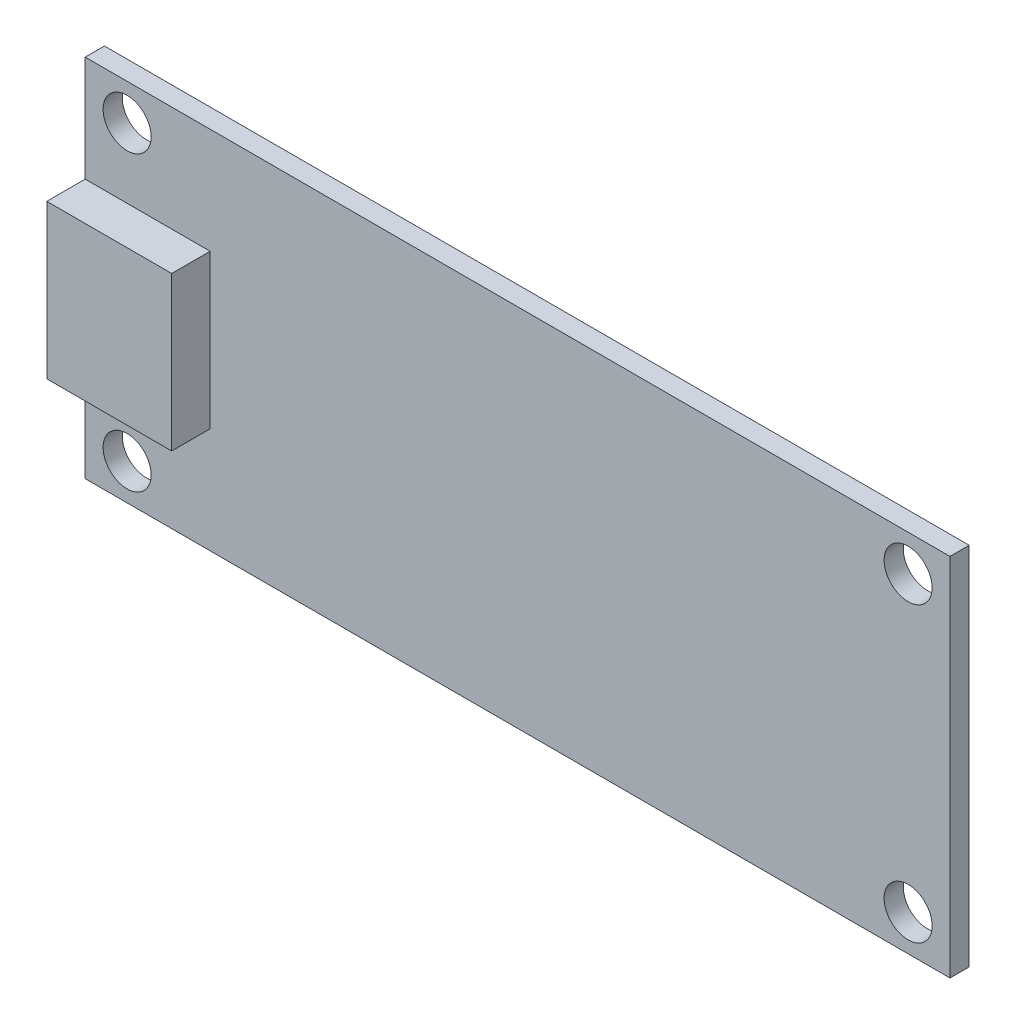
ISO-10303-21;
HEADER;
FILE_DESCRIPTION(('STEP AP214'),'2;1');
FILE_NAME('part.step','',(''),(''),'','','');
FILE_SCHEMA(('AUTOMOTIVE_DESIGN { 1 0 10303 214 1 1 1 1 }'));
ENDSEC;
DATA;
#1=APPLICATION_CONTEXT('core data for automotive mechanical design processes');
#2=APPLICATION_PROTOCOL_DEFINITION('international standard','automotive_design',2000,#1);
#3=PRODUCT_CONTEXT('',#1,'mechanical');
#4=PRODUCT('Part','Part','',(#3));
#5=PRODUCT_RELATED_PRODUCT_CATEGORY('part','',(#4));
#6=PRODUCT_DEFINITION_FORMATION('','',#4);
#7=PRODUCT_DEFINITION_CONTEXT('part definition',#1,'design');
#8=PRODUCT_DEFINITION('design','',#6,#7);
#9=PRODUCT_DEFINITION_SHAPE('','',#8);
#10=(LENGTH_UNIT() NAMED_UNIT(*) SI_UNIT(.MILLI.,.METRE.));
#11=(NAMED_UNIT(*) PLANE_ANGLE_UNIT() SI_UNIT($,.RADIAN.));
#12=(NAMED_UNIT(*) SI_UNIT($,.STERADIAN.) SOLID_ANGLE_UNIT());
#13=UNCERTAINTY_MEASURE_WITH_UNIT(LENGTH_MEASURE(1.E-05),#10,'distance_accuracy_value','');
#14=(GEOMETRIC_REPRESENTATION_CONTEXT(3) GLOBAL_UNCERTAINTY_ASSIGNED_CONTEXT((#13)) GLOBAL_UNIT_ASSIGNED_CONTEXT((#10,
#11,#12)) REPRESENTATION_CONTEXT('',''));
#15=CARTESIAN_POINT('',(0.,0.,0.));
#16=DIRECTION('',(0.,0.,1.));
#17=DIRECTION('',(1.,0.,0.));
#18=AXIS2_PLACEMENT_3D('',#15,#16,#17);
#19=CARTESIAN_POINT('',(0.,9.5,1.));
#20=DIRECTION('',(0.,1.,0.));
#21=DIRECTION('',(0.,0.,1.));
#22=AXIS2_PLACEMENT_3D('',#19,#20,#21);
#23=PLANE('',#22);
#24=DIRECTION('',(1.,0.,0.));
#25=VECTOR('',#24,1.);
#26=CARTESIAN_POINT('',(0.,9.5,0.));
#27=LINE('',#26,#25);
#28=CARTESIAN_POINT('',(-22.5,9.5,0.));
#29=VERTEX_POINT('',#28);
#30=CARTESIAN_POINT('',(22.5,9.5,0.));
#31=VERTEX_POINT('',#30);
#32=EDGE_CURVE('E162',#29,#31,#27,.T.);
#33=ORIENTED_EDGE('',*,*,#32,.F.);
#34=DIRECTION('',(0.,0.,-1.));
#35=VECTOR('',#34,1.);
#36=CARTESIAN_POINT('',(-22.5,9.5,1.));
#37=LINE('',#36,#35);
#38=CARTESIAN_POINT('',(-22.5,9.5,1.));
#39=VERTEX_POINT('',#38);
#40=EDGE_CURVE('E11',#39,#29,#37,.T.);
#41=ORIENTED_EDGE('',*,*,#40,.F.);
#42=DIRECTION('',(1.,0.,0.));
#43=VECTOR('',#42,1.);
#44=CARTESIAN_POINT('',(0.,9.5,1.));
#45=LINE('',#44,#43);
#46=CARTESIAN_POINT('',(22.5,9.5,1.));
#47=VERTEX_POINT('',#46);
#48=EDGE_CURVE('E142',#39,#47,#45,.T.);
#49=ORIENTED_EDGE('',*,*,#48,.T.);
#50=DIRECTION('',(0.,0.,-1.));
#51=VECTOR('',#50,1.);
#52=CARTESIAN_POINT('',(22.5,9.5,1.));
#53=LINE('',#52,#51);
#54=EDGE_CURVE('E155',#47,#31,#53,.T.);
#55=ORIENTED_EDGE('',*,*,#54,.T.);
#56=EDGE_LOOP('',(#33,#41,#49,#55));
#57=FACE_BOUND('',#56,.T.);
#58=ADVANCED_FACE('F36',(#57),#23,.T.);
#59=CARTESIAN_POINT('',(-22.5,0.,1.));
#60=DIRECTION('',(-1.,0.,0.));
#61=DIRECTION('',(0.,0.,1.));
#62=AXIS2_PLACEMENT_3D('',#59,#60,#61);
#63=PLANE('',#62);
#64=DIRECTION('',(0.,1.,0.));
#65=VECTOR('',#64,1.);
#66=CARTESIAN_POINT('',(-22.5,0.,0.));
#67=LINE('',#66,#65);
#68=CARTESIAN_POINT('',(-22.5,-9.5,0.));
#69=VERTEX_POINT('',#68);
#70=EDGE_CURVE('E165',#69,#29,#67,.T.);
#71=ORIENTED_EDGE('',*,*,#70,.F.);
#72=DIRECTION('',(0.,0.,-1.));
#73=VECTOR('',#72,1.);
#74=CARTESIAN_POINT('',(-22.5,-9.5,1.));
#75=LINE('',#74,#73);
#76=CARTESIAN_POINT('',(-22.5,-9.5,1.));
#77=VERTEX_POINT('',#76);
#78=EDGE_CURVE('E44',#77,#69,#75,.T.);
#79=ORIENTED_EDGE('',*,*,#78,.F.);
#80=DIRECTION('',(0.,1.,0.));
#81=VECTOR('',#80,1.);
#82=CARTESIAN_POINT('',(-22.5,0.,1.));
#83=LINE('',#82,#81);
#84=CARTESIAN_POINT('',(-22.5,-4.,1.));
#85=VERTEX_POINT('',#84);
#86=EDGE_CURVE('E145',#77,#85,#83,.T.);
#87=ORIENTED_EDGE('',*,*,#86,.T.);
#88=DIRECTION('',(0.,0.,-1.));
#89=VECTOR('',#88,1.);
#90=CARTESIAN_POINT('',(-22.5,-4.,3.));
#91=LINE('',#90,#89);
#92=CARTESIAN_POINT('',(-22.5,-4.,3.));
#93=VERTEX_POINT('',#92);
#94=EDGE_CURVE('E199',#93,#85,#91,.T.);
#95=ORIENTED_EDGE('',*,*,#94,.F.);
#96=DIRECTION('',(0.,1.,0.));
#97=VECTOR('',#96,1.);
#98=CARTESIAN_POINT('',(-22.5,0.,3.));
#99=LINE('',#98,#97);
#100=CARTESIAN_POINT('',(-22.5,4.,3.));
#101=VERTEX_POINT('',#100);
#102=EDGE_CURVE('E116',#93,#101,#99,.T.);
#103=ORIENTED_EDGE('',*,*,#102,.T.);
#104=DIRECTION('',(0.,0.,-1.));
#105=VECTOR('',#104,1.);
#106=CARTESIAN_POINT('',(-22.5,4.,3.));
#107=LINE('',#106,#105);
#108=CARTESIAN_POINT('',(-22.5,4.,1.));
#109=VERTEX_POINT('',#108);
#110=EDGE_CURVE('E128',#101,#109,#107,.T.);
#111=ORIENTED_EDGE('',*,*,#110,.T.);
#112=EDGE_CURVE('E57',#109,#39,#83,.T.);
#113=ORIENTED_EDGE('',*,*,#112,.T.);
#114=ORIENTED_EDGE('',*,*,#40,.T.);
#115=EDGE_LOOP('',(#71,#79,#87,#95,#103,#111,#113,#114));
#116=FACE_BOUND('',#115,.T.);
#117=ADVANCED_FACE('F190',(#116),#63,.T.);
#118=CARTESIAN_POINT('',(0.,-9.5,1.));
#119=DIRECTION('',(0.,1.,0.));
#120=DIRECTION('',(0.,0.,1.));
#121=AXIS2_PLACEMENT_3D('',#118,#119,#120);
#122=PLANE('',#121);
#123=DIRECTION('',(1.,0.,0.));
#124=VECTOR('',#123,1.);
#125=CARTESIAN_POINT('',(0.,-9.5,0.));
#126=LINE('',#125,#124);
#127=CARTESIAN_POINT('',(22.5,-9.5,0.));
#128=VERTEX_POINT('',#127);
#129=EDGE_CURVE('E168',#69,#128,#126,.T.);
#130=ORIENTED_EDGE('',*,*,#129,.T.);
#131=DIRECTION('',(0.,0.,-1.));
#132=VECTOR('',#131,1.);
#133=CARTESIAN_POINT('',(22.5,-9.5,1.));
#134=LINE('',#133,#132);
#135=CARTESIAN_POINT('',(22.5,-9.5,1.));
#136=VERTEX_POINT('',#135);
#137=EDGE_CURVE('E177',#136,#128,#134,.T.);
#138=ORIENTED_EDGE('',*,*,#137,.F.);
#139=DIRECTION('',(1.,0.,0.));
#140=VECTOR('',#139,1.);
#141=CARTESIAN_POINT('',(0.,-9.5,1.));
#142=LINE('',#141,#140);
#143=EDGE_CURVE('E148',#77,#136,#142,.T.);
#144=ORIENTED_EDGE('',*,*,#143,.F.);
#145=ORIENTED_EDGE('',*,*,#78,.T.);
#146=EDGE_LOOP('',(#130,#138,#144,#145));
#147=FACE_BOUND('',#146,.T.);
#148=ADVANCED_FACE('F182',(#147),#122,.F.);
#149=CARTESIAN_POINT('',(22.5,0.,1.));
#150=DIRECTION('',(-1.,0.,0.));
#151=DIRECTION('',(0.,0.,1.));
#152=AXIS2_PLACEMENT_3D('',#149,#150,#151);
#153=PLANE('',#152);
#154=DIRECTION('',(0.,1.,0.));
#155=VECTOR('',#154,1.);
#156=CARTESIAN_POINT('',(22.5,0.,0.));
#157=LINE('',#156,#155);
#158=EDGE_CURVE('E171',#128,#31,#157,.T.);
#159=ORIENTED_EDGE('',*,*,#158,.T.);
#160=ORIENTED_EDGE('',*,*,#54,.F.);
#161=DIRECTION('',(0.,1.,0.));
#162=VECTOR('',#161,1.);
#163=CARTESIAN_POINT('',(22.5,0.,1.));
#164=LINE('',#163,#162);
#165=EDGE_CURVE('E151',#136,#47,#164,.T.);
#166=ORIENTED_EDGE('',*,*,#165,.F.);
#167=ORIENTED_EDGE('',*,*,#137,.T.);
#168=EDGE_LOOP('',(#159,#160,#166,#167));
#169=FACE_BOUND('',#168,.T.);
#170=ADVANCED_FACE('F196',(#169),#153,.F.);
#171=CARTESIAN_POINT('',(-20.32,-7.62,1.));
#172=DIRECTION('',(0.,0.,-1.));
#173=DIRECTION('',(-1.,0.,0.));
#174=AXIS2_PLACEMENT_3D('',#171,#172,#173);
#175=CYLINDRICAL_SURFACE('',#174,1.25);
#176=CARTESIAN_POINT('',(-20.32,-7.62,1.));
#177=DIRECTION('',(0.,0.,1.));
#178=DIRECTION('',(1.,0.,0.));
#179=AXIS2_PLACEMENT_3D('',#176,#177,#178);
#180=CIRCLE('',#179,1.25);
#181=CARTESIAN_POINT('',(-19.07,-7.62,1.));
#182=VERTEX_POINT('',#181);
#183=EDGE_CURVE('E139',#182,#182,#180,.T.);
#184=ORIENTED_EDGE('',*,*,#183,.T.);
#185=EDGE_LOOP('',(#184));
#186=FACE_BOUND('',#185,.T.);
#187=CARTESIAN_POINT('',(-20.32,-7.62,0.));
#188=DIRECTION('',(0.,0.,1.));
#189=DIRECTION('',(1.,0.,0.));
#190=AXIS2_PLACEMENT_3D('',#187,#188,#189);
#191=CIRCLE('',#190,1.25);
#192=CARTESIAN_POINT('',(-19.07,-7.62,0.));
#193=VERTEX_POINT('',#192);
#194=EDGE_CURVE('E159',#193,#193,#191,.T.);
#195=ORIENTED_EDGE('',*,*,#194,.F.);
#196=EDGE_LOOP('',(#195));
#197=FACE_BOUND('',#196,.T.);
#198=ADVANCED_FACE('F225',(#186,#197),#175,.F.);
#199=CARTESIAN_POINT('',(-20.32,7.62,1.));
#200=DIRECTION('',(0.,0.,-1.));
#201=DIRECTION('',(-1.,0.,0.));
#202=AXIS2_PLACEMENT_3D('',#199,#200,#201);
#203=CYLINDRICAL_SURFACE('',#202,1.25);
#204=CARTESIAN_POINT('',(-20.32,7.62,1.));
#205=DIRECTION('',(0.,0.,1.));
#206=DIRECTION('',(1.,0.,0.));
#207=AXIS2_PLACEMENT_3D('',#204,#205,#206);
#208=CIRCLE('',#207,1.25);
#209=CARTESIAN_POINT('',(-19.07,7.62,1.));
#210=VERTEX_POINT('',#209);
#211=EDGE_CURVE('E135',#210,#210,#208,.F.);
#212=ORIENTED_EDGE('',*,*,#211,.F.);
#213=EDGE_LOOP('',(#212));
#214=FACE_BOUND('',#213,.T.);
#215=CARTESIAN_POINT('',(-20.32,7.62,0.));
#216=DIRECTION('',(0.,0.,1.));
#217=DIRECTION('',(1.,0.,0.));
#218=AXIS2_PLACEMENT_3D('',#215,#216,#217);
#219=CIRCLE('',#218,1.25);
#220=CARTESIAN_POINT('',(-19.07,7.62,0.));
#221=VERTEX_POINT('',#220);
#222=EDGE_CURVE('E126',#221,#221,#219,.F.);
#223=ORIENTED_EDGE('',*,*,#222,.T.);
#224=EDGE_LOOP('',(#223));
#225=FACE_BOUND('',#224,.T.);
#226=ADVANCED_FACE('F227',(#214,#225),#203,.F.);
#227=CARTESIAN_POINT('',(20.32,7.62,1.));
#228=DIRECTION('',(0.,0.,-1.));
#229=DIRECTION('',(-1.,0.,0.));
#230=AXIS2_PLACEMENT_3D('',#227,#228,#229);
#231=CYLINDRICAL_SURFACE('',#230,1.25);
#232=CARTESIAN_POINT('',(20.32,7.62,1.));
#233=DIRECTION('',(0.,0.,1.));
#234=DIRECTION('',(1.,0.,0.));
#235=AXIS2_PLACEMENT_3D('',#232,#233,#234);
#236=CIRCLE('',#235,1.25);
#237=CARTESIAN_POINT('',(21.57,7.62,1.));
#238=VERTEX_POINT('',#237);
#239=EDGE_CURVE('E132',#238,#238,#236,.T.);
#240=ORIENTED_EDGE('',*,*,#239,.T.);
#241=EDGE_LOOP('',(#240));
#242=FACE_BOUND('',#241,.T.);
#243=CARTESIAN_POINT('',(20.32,7.62,0.));
#244=DIRECTION('',(0.,0.,1.));
#245=DIRECTION('',(1.,0.,0.));
#246=AXIS2_PLACEMENT_3D('',#243,#244,#245);
#247=CIRCLE('',#246,1.25);
#248=CARTESIAN_POINT('',(21.57,7.62,0.));
#249=VERTEX_POINT('',#248);
#250=EDGE_CURVE('E123',#249,#249,#247,.T.);
#251=ORIENTED_EDGE('',*,*,#250,.F.);
#252=EDGE_LOOP('',(#251));
#253=FACE_BOUND('',#252,.T.);
#254=ADVANCED_FACE('F38',(#242,#253),#231,.F.);
#255=CARTESIAN_POINT('',(20.32,-7.61999999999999,1.));
#256=DIRECTION('',(0.,0.,-1.));
#257=DIRECTION('',(-1.,0.,0.));
#258=AXIS2_PLACEMENT_3D('',#255,#256,#257);
#259=CYLINDRICAL_SURFACE('',#258,1.25);
#260=CARTESIAN_POINT('',(20.32,-7.61999999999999,1.));
#261=DIRECTION('',(0.,0.,1.));
#262=DIRECTION('',(1.,0.,0.));
#263=AXIS2_PLACEMENT_3D('',#260,#261,#262);
#264=CIRCLE('',#263,1.25);
#265=CARTESIAN_POINT('',(21.57,-7.61999999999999,1.));
#266=VERTEX_POINT('',#265);
#267=EDGE_CURVE('E153',#266,#266,#264,.F.);
#268=ORIENTED_EDGE('',*,*,#267,.F.);
#269=EDGE_LOOP('',(#268));
#270=FACE_BOUND('',#269,.T.);
#271=CARTESIAN_POINT('',(20.32,-7.61999999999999,0.));
#272=DIRECTION('',(0.,0.,1.));
#273=DIRECTION('',(1.,0.,0.));
#274=AXIS2_PLACEMENT_3D('',#271,#272,#273);
#275=CIRCLE('',#274,1.25);
#276=CARTESIAN_POINT('',(21.57,-7.61999999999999,0.));
#277=VERTEX_POINT('',#276);
#278=EDGE_CURVE('E136',#277,#277,#275,.F.);
#279=ORIENTED_EDGE('',*,*,#278,.T.);
#280=EDGE_LOOP('',(#279));
#281=FACE_BOUND('',#280,.T.);
#282=ADVANCED_FACE('F234',(#270,#281),#259,.F.);
#283=CARTESIAN_POINT('',(0.,0.,1.));
#284=DIRECTION('',(0.,0.,1.));
#285=DIRECTION('',(1.,0.,0.));
#286=AXIS2_PLACEMENT_3D('',#283,#284,#285);
#287=PLANE('',#286);
#288=DIRECTION('',(1.,0.,0.));
#289=VECTOR('',#288,1.);
#290=CARTESIAN_POINT('',(0.,-4.,1.));
#291=LINE('',#290,#289);
#292=CARTESIAN_POINT('',(-16.,-4.,1.));
#293=VERTEX_POINT('',#292);
#294=EDGE_CURVE('E122',#85,#293,#291,.T.);
#295=ORIENTED_EDGE('',*,*,#294,.F.);
#296=ORIENTED_EDGE('',*,*,#86,.F.);
#297=ORIENTED_EDGE('',*,*,#143,.T.);
#298=ORIENTED_EDGE('',*,*,#165,.T.);
#299=ORIENTED_EDGE('',*,*,#48,.F.);
#300=ORIENTED_EDGE('',*,*,#112,.F.);
#301=DIRECTION('',(1.,0.,0.));
#302=VECTOR('',#301,1.);
#303=CARTESIAN_POINT('',(0.,4.,1.));
#304=LINE('',#303,#302);
#305=CARTESIAN_POINT('',(-16.,4.,1.));
#306=VERTEX_POINT('',#305);
#307=EDGE_CURVE('E119',#109,#306,#304,.T.);
#308=ORIENTED_EDGE('',*,*,#307,.T.);
#309=DIRECTION('',(0.,1.,0.));
#310=VECTOR('',#309,1.);
#311=CARTESIAN_POINT('',(-16.,0.,1.));
#312=LINE('',#311,#310);
#313=EDGE_CURVE('E51',#293,#306,#312,.T.);
#314=ORIENTED_EDGE('',*,*,#313,.F.);
#315=EDGE_LOOP('',(#295,#296,#297,#298,#299,#300,#308,#314));
#316=FACE_BOUND('',#315,.T.);
#317=ORIENTED_EDGE('',*,*,#239,.F.);
#318=EDGE_LOOP('',(#317));
#319=FACE_BOUND('',#318,.T.);
#320=ORIENTED_EDGE('',*,*,#211,.T.);
#321=EDGE_LOOP('',(#320));
#322=FACE_BOUND('',#321,.T.);
#323=ORIENTED_EDGE('',*,*,#183,.F.);
#324=EDGE_LOOP('',(#323));
#325=FACE_BOUND('',#324,.T.);
#326=ORIENTED_EDGE('',*,*,#267,.T.);
#327=EDGE_LOOP('',(#326));
#328=FACE_BOUND('',#327,.T.);
#329=ADVANCED_FACE('F197',(#316,#319,#322,#325,#328),#287,.T.);
#330=CARTESIAN_POINT('',(0.,0.,0.));
#331=DIRECTION('',(0.,0.,1.));
#332=DIRECTION('',(1.,0.,0.));
#333=AXIS2_PLACEMENT_3D('',#330,#331,#332);
#334=PLANE('',#333);
#335=ORIENTED_EDGE('',*,*,#250,.T.);
#336=EDGE_LOOP('',(#335));
#337=FACE_BOUND('',#336,.T.);
#338=ORIENTED_EDGE('',*,*,#222,.F.);
#339=EDGE_LOOP('',(#338));
#340=FACE_BOUND('',#339,.T.);
#341=ORIENTED_EDGE('',*,*,#194,.T.);
#342=EDGE_LOOP('',(#341));
#343=FACE_BOUND('',#342,.T.);
#344=ORIENTED_EDGE('',*,*,#32,.T.);
#345=ORIENTED_EDGE('',*,*,#158,.F.);
#346=ORIENTED_EDGE('',*,*,#129,.F.);
#347=ORIENTED_EDGE('',*,*,#70,.T.);
#348=EDGE_LOOP('',(#344,#345,#346,#347));
#349=FACE_BOUND('',#348,.T.);
#350=ORIENTED_EDGE('',*,*,#278,.F.);
#351=EDGE_LOOP('',(#350));
#352=FACE_BOUND('',#351,.T.);
#353=ADVANCED_FACE('F188',(#337,#340,#343,#349,#352),#334,.F.);
#354=CARTESIAN_POINT('',(0.,-4.,3.));
#355=DIRECTION('',(0.,1.,0.));
#356=DIRECTION('',(0.,0.,1.));
#357=AXIS2_PLACEMENT_3D('',#354,#355,#356);
#358=PLANE('',#357);
#359=ORIENTED_EDGE('',*,*,#294,.T.);
#360=DIRECTION('',(0.,0.,-1.));
#361=VECTOR('',#360,1.);
#362=CARTESIAN_POINT('',(-16.,-4.,3.));
#363=LINE('',#362,#361);
#364=CARTESIAN_POINT('',(-16.,-4.,3.));
#365=VERTEX_POINT('',#364);
#366=EDGE_CURVE('E102',#365,#293,#363,.T.);
#367=ORIENTED_EDGE('',*,*,#366,.F.);
#368=DIRECTION('',(1.,0.,0.));
#369=VECTOR('',#368,1.);
#370=CARTESIAN_POINT('',(0.,-4.,3.));
#371=LINE('',#370,#369);
#372=EDGE_CURVE('E110',#93,#365,#371,.T.);
#373=ORIENTED_EDGE('',*,*,#372,.F.);
#374=ORIENTED_EDGE('',*,*,#94,.T.);
#375=EDGE_LOOP('',(#359,#367,#373,#374));
#376=FACE_BOUND('',#375,.T.);
#377=ADVANCED_FACE('F121',(#376),#358,.F.);
#378=CARTESIAN_POINT('',(-16.,0.,3.));
#379=DIRECTION('',(-1.,0.,0.));
#380=DIRECTION('',(0.,0.,1.));
#381=AXIS2_PLACEMENT_3D('',#378,#379,#380);
#382=PLANE('',#381);
#383=ORIENTED_EDGE('',*,*,#313,.T.);
#384=DIRECTION('',(0.,0.,-1.));
#385=VECTOR('',#384,1.);
#386=CARTESIAN_POINT('',(-16.,4.,3.));
#387=LINE('',#386,#385);
#388=CARTESIAN_POINT('',(-16.,4.,3.));
#389=VERTEX_POINT('',#388);
#390=EDGE_CURVE('E105',#389,#306,#387,.T.);
#391=ORIENTED_EDGE('',*,*,#390,.F.);
#392=DIRECTION('',(0.,1.,0.));
#393=VECTOR('',#392,1.);
#394=CARTESIAN_POINT('',(-16.,0.,3.));
#395=LINE('',#394,#393);
#396=EDGE_CURVE('E98',#365,#389,#395,.T.);
#397=ORIENTED_EDGE('',*,*,#396,.F.);
#398=ORIENTED_EDGE('',*,*,#366,.T.);
#399=EDGE_LOOP('',(#383,#391,#397,#398));
#400=FACE_BOUND('',#399,.T.);
#401=ADVANCED_FACE('F100',(#400),#382,.F.);
#402=CARTESIAN_POINT('',(0.,4.,3.));
#403=DIRECTION('',(0.,1.,0.));
#404=DIRECTION('',(0.,0.,1.));
#405=AXIS2_PLACEMENT_3D('',#402,#403,#404);
#406=PLANE('',#405);
#407=ORIENTED_EDGE('',*,*,#307,.F.);
#408=ORIENTED_EDGE('',*,*,#110,.F.);
#409=DIRECTION('',(1.,0.,0.));
#410=VECTOR('',#409,1.);
#411=CARTESIAN_POINT('',(0.,4.,3.));
#412=LINE('',#411,#410);
#413=EDGE_CURVE('E109',#101,#389,#412,.T.);
#414=ORIENTED_EDGE('',*,*,#413,.T.);
#415=ORIENTED_EDGE('',*,*,#390,.T.);
#416=EDGE_LOOP('',(#407,#408,#414,#415));
#417=FACE_BOUND('',#416,.T.);
#418=ADVANCED_FACE('F208',(#417),#406,.T.);
#419=CARTESIAN_POINT('',(0.,0.,3.));
#420=DIRECTION('',(0.,0.,1.));
#421=DIRECTION('',(1.,0.,0.));
#422=AXIS2_PLACEMENT_3D('',#419,#420,#421);
#423=PLANE('',#422);
#424=ORIENTED_EDGE('',*,*,#372,.T.);
#425=ORIENTED_EDGE('',*,*,#396,.T.);
#426=ORIENTED_EDGE('',*,*,#413,.F.);
#427=ORIENTED_EDGE('',*,*,#102,.F.);
#428=EDGE_LOOP('',(#424,#425,#426,#427));
#429=FACE_BOUND('',#428,.T.);
#430=ADVANCED_FACE('F114',(#429),#423,.T.);
#431=CLOSED_SHELL('',(#58,#117,#148,#170,#198,#226,#254,#282,#329,#353,#377,#401,#418,#430));
#432=MANIFOLD_SOLID_BREP('B2',#431);
#433=ADVANCED_BREP_SHAPE_REPRESENTATION('',(#18,#432),#14);
#434=SHAPE_DEFINITION_REPRESENTATION(#9,#433);
ENDSEC;
END-ISO-10303-21;
